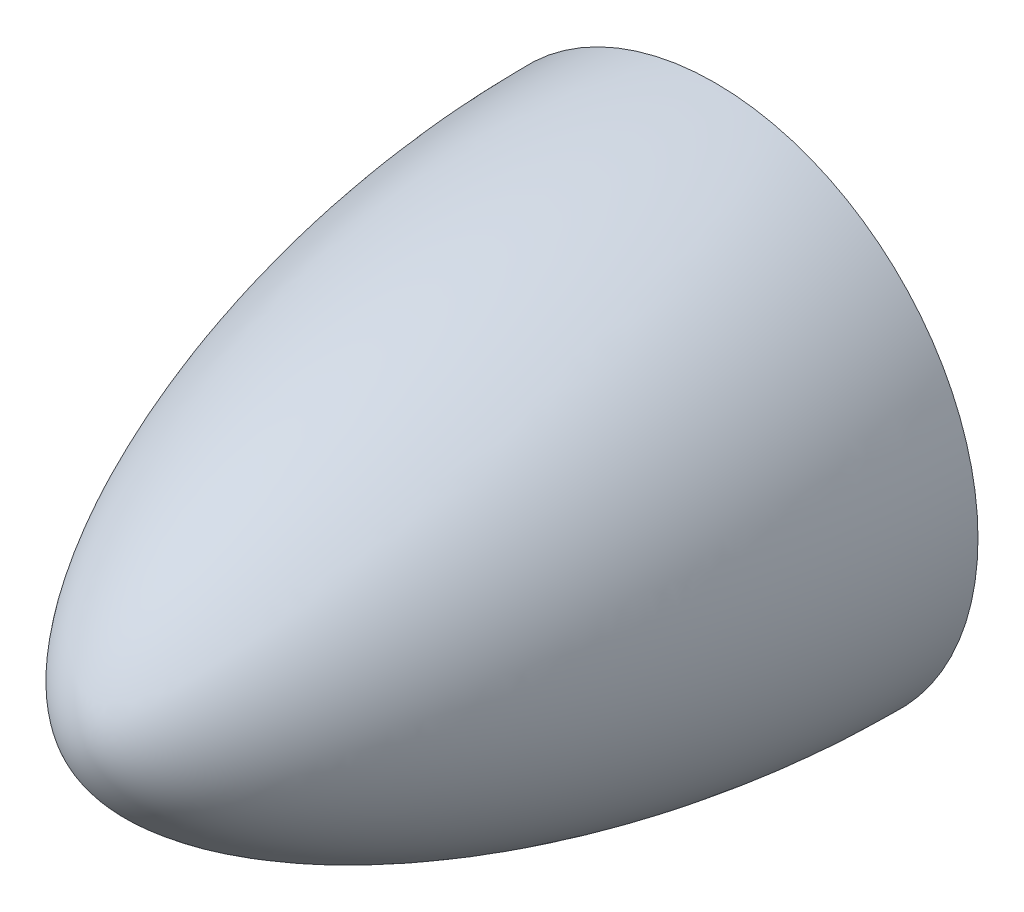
from build123d import *

# Parameters (mm, degrees)
ESQUISSE2_R             = 1
ENL_V_MAT_EXTRU_1_DEPTH = 3


with BuildPart() as part:
    # Esquisse1 → R_volution1 (revolve)
    with BuildSketch(Plane(origin=(0, 0, 0), x_dir=(0, 0, -1), z_dir=(1, 0, 0))):
        with BuildLine():
            Line((0, 5), (0, 0))
            Line((0, 0), (-12, 0))
            add(Edge.make_bspline(
                [(0, 5), (-6.179602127, 5.008250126), (-11.994937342, 2.204146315), (-12, 0)],
                knots=[0, 0, 0, 0, 0.815099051, 0.815099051, 0.815099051, 0.815099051], degree=3))
        make_face()
    revolve(axis=Axis((0, 0, 14.316831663), (0, 0, -1)))

    # Esquisse2 → Enl_v. mat.-Extru.1 (cut)
    with BuildSketch(Plane(origin=(0, 0, 0), x_dir=(-1, 0, 0), z_dir=(0, 0, -1))):
        Circle(ESQUISSE2_R)
    extrude(amount=-ENL_V_MAT_EXTRU_1_DEPTH, mode=Mode.SUBTRACT)


solid = part.part
